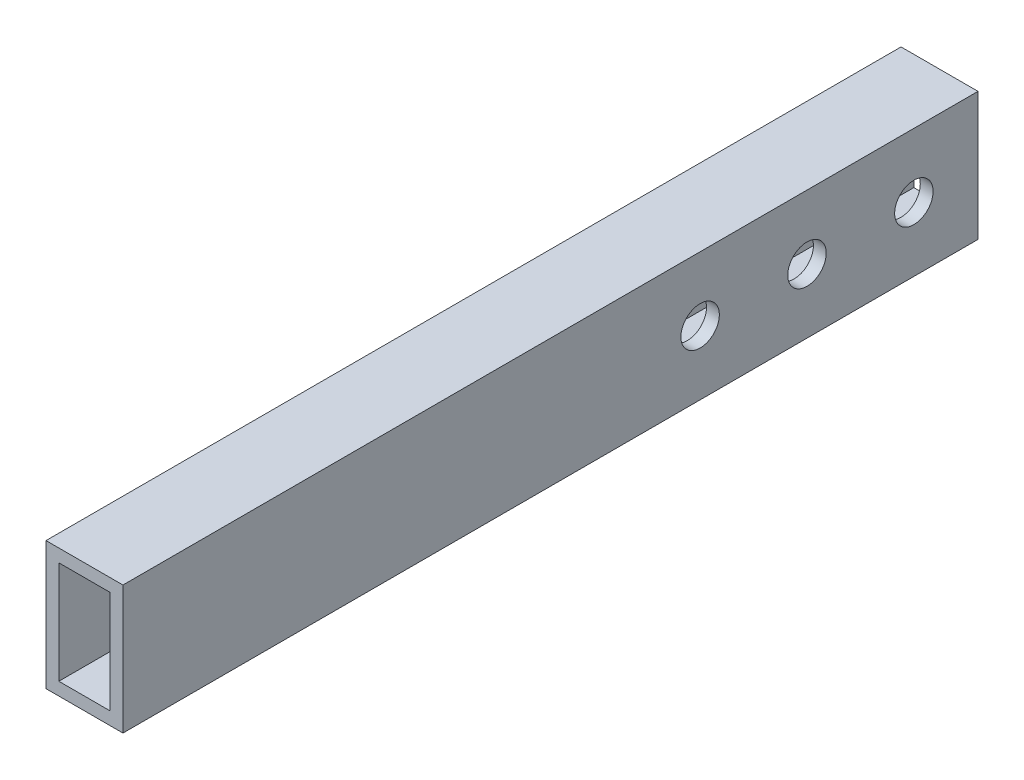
from build123d import *

# Parameters (mm, degrees)
ESQUISSE1_W                = 18
ESQUISSE1_H                = 30
ESQUISSE1_W_2              = 12
ESQUISSE1_H_2              = 24
BASE_EXTRUSION_DEPTH       = 200
PER_AGE1_D                 = 9
R_P_TITION_LIN_AIRE2_COUNT = 3
R_P_TITION_LIN_AIRE2_PITCH = 25


with BuildPart() as part:
    # Esquisse1 → Base-Extrusion (new body)
    with BuildSketch(Plane.XY):
        Rectangle(ESQUISSE1_W, ESQUISSE1_H)
        Rectangle(ESQUISSE1_W_2, ESQUISSE1_H_2, mode=Mode.SUBTRACT)
    extrude(amount=BASE_EXTRUSION_DEPTH)

    # Per_age1 (through all)
    with Locations(Plane(origin=(9, 0, 0), x_dir=(0, 0, -1), z_dir=(1, 0, 0))):
        with Locations((-15, 0)):
            per_age1 = Hole(PER_AGE1_D / 2)

    # R_p_tition lin_aire2: Per_age1 ×3
    with Locations(*[(0, 0, i * R_P_TITION_LIN_AIRE2_PITCH) for i in range(1, R_P_TITION_LIN_AIRE2_COUNT)]):
        add(per_age1, mode=Mode.SUBTRACT)


solid = part.part
